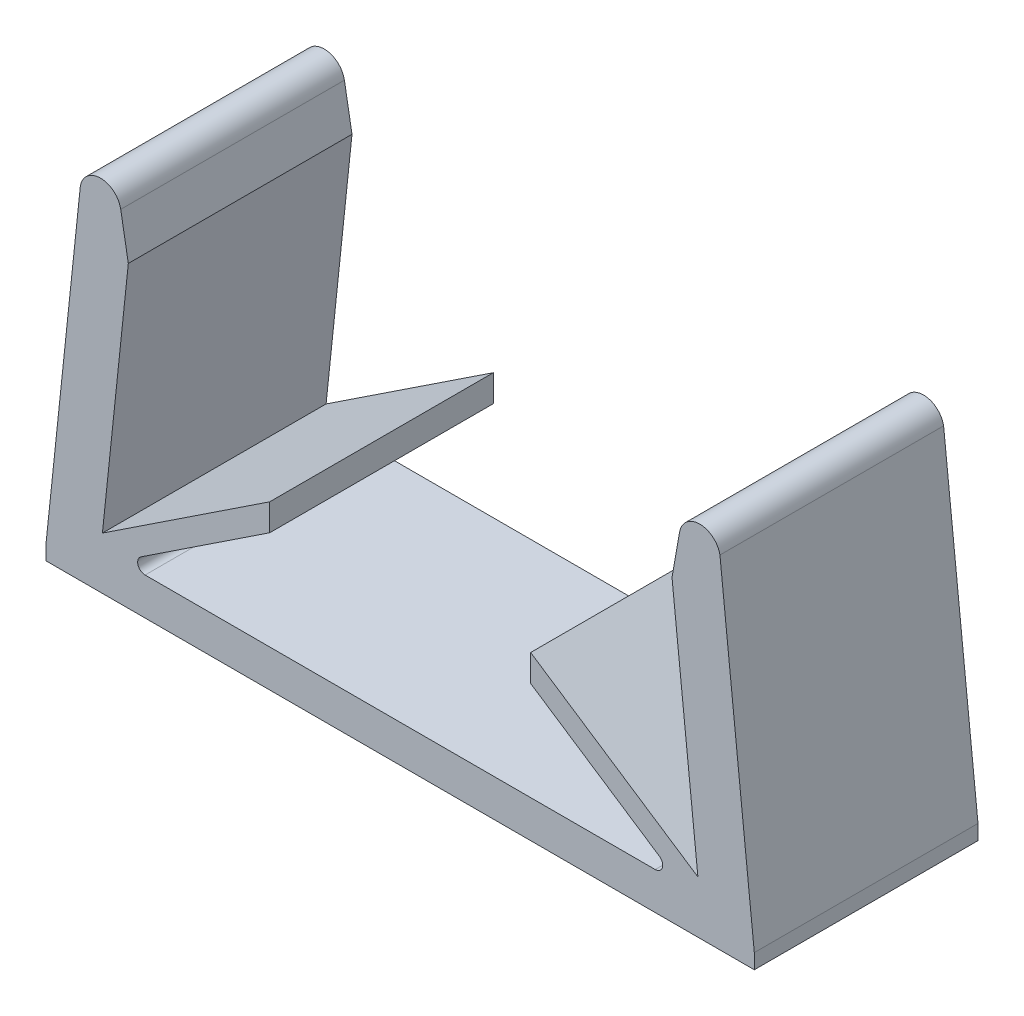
ISO-10303-21;
HEADER;
FILE_DESCRIPTION(('STEP AP214'),'2;1');
FILE_NAME('part.step','',(''),(''),'','','');
FILE_SCHEMA(('AUTOMOTIVE_DESIGN { 1 0 10303 214 1 1 1 1 }'));
ENDSEC;
DATA;
#1=APPLICATION_CONTEXT('core data for automotive mechanical design processes');
#2=APPLICATION_PROTOCOL_DEFINITION('international standard','automotive_design',2000,#1);
#3=PRODUCT_CONTEXT('',#1,'mechanical');
#4=PRODUCT('Part','Part','',(#3));
#5=PRODUCT_RELATED_PRODUCT_CATEGORY('part','',(#4));
#6=PRODUCT_DEFINITION_FORMATION('','',#4);
#7=PRODUCT_DEFINITION_CONTEXT('part definition',#1,'design');
#8=PRODUCT_DEFINITION('design','',#6,#7);
#9=PRODUCT_DEFINITION_SHAPE('','',#8);
#10=(LENGTH_UNIT() NAMED_UNIT(*) SI_UNIT(.MILLI.,.METRE.));
#11=(NAMED_UNIT(*) PLANE_ANGLE_UNIT() SI_UNIT($,.RADIAN.));
#12=(NAMED_UNIT(*) SI_UNIT($,.STERADIAN.) SOLID_ANGLE_UNIT());
#13=UNCERTAINTY_MEASURE_WITH_UNIT(LENGTH_MEASURE(1.E-05),#10,'distance_accuracy_value','');
#14=(GEOMETRIC_REPRESENTATION_CONTEXT(3) GLOBAL_UNCERTAINTY_ASSIGNED_CONTEXT((#13)) GLOBAL_UNIT_ASSIGNED_CONTEXT((#10,
#11,#12)) REPRESENTATION_CONTEXT('',''));
#15=CARTESIAN_POINT('',(0.,0.,0.));
#16=DIRECTION('',(0.,0.,1.));
#17=DIRECTION('',(1.,0.,0.));
#18=AXIS2_PLACEMENT_3D('',#15,#16,#17);
#19=CARTESIAN_POINT('',(6.84138339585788,1.20000000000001,3.));
#20=DIRECTION('',(0.,0.,-1.));
#21=DIRECTION('',(-1.,0.,0.));
#22=AXIS2_PLACEMENT_3D('',#19,#20,#21);
#23=CYLINDRICAL_SURFACE('',#22,0.2);
#24=CARTESIAN_POINT('',(6.84138339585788,1.20000000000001,-3.));
#25=DIRECTION('',(0.,0.,-1.));
#26=DIRECTION('',(-1.,0.,0.));
#27=AXIS2_PLACEMENT_3D('',#24,#25,#26);
#28=CIRCLE('',#27,0.2);
#29=CARTESIAN_POINT('',(6.95177079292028,1.36677716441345,-3.));
#30=VERTEX_POINT('',#29);
#31=CARTESIAN_POINT('',(6.84138339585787,1.00000000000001,-3.));
#32=VERTEX_POINT('',#31);
#33=EDGE_CURVE('E207',#30,#32,#28,.T.);
#34=ORIENTED_EDGE('',*,*,#33,.T.);
#35=DIRECTION('',(0.,0.,-1.));
#36=VECTOR('',#35,1.);
#37=CARTESIAN_POINT('',(6.84138339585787,1.00000000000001,3.));
#38=LINE('',#37,#36);
#39=CARTESIAN_POINT('',(6.84138339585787,1.00000000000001,3.));
#40=VERTEX_POINT('',#39);
#41=EDGE_CURVE('E11',#40,#32,#38,.T.);
#42=ORIENTED_EDGE('',*,*,#41,.F.);
#43=CARTESIAN_POINT('',(6.84138339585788,1.20000000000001,3.));
#44=DIRECTION('',(0.,0.,-1.));
#45=DIRECTION('',(-1.,0.,0.));
#46=AXIS2_PLACEMENT_3D('',#43,#44,#45);
#47=CIRCLE('',#46,0.2);
#48=CARTESIAN_POINT('',(6.95177079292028,1.36677716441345,3.));
#49=VERTEX_POINT('',#48);
#50=EDGE_CURVE('E245',#49,#40,#47,.T.);
#51=ORIENTED_EDGE('',*,*,#50,.F.);
#52=DIRECTION('',(0.,0.,-1.));
#53=VECTOR('',#52,1.);
#54=CARTESIAN_POINT('',(6.95177079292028,1.36677716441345,3.));
#55=LINE('',#54,#53);
#56=EDGE_CURVE('E203',#49,#30,#55,.T.);
#57=ORIENTED_EDGE('',*,*,#56,.T.);
#58=EDGE_LOOP('',(#34,#42,#51,#57));
#59=FACE_BOUND('',#58,.T.);
#60=ADVANCED_FACE('F39',(#59),#23,.F.);
#61=CARTESIAN_POINT('',(-6.84138339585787,1.00000000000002,3.));
#62=DIRECTION('',(0.,-1.,0.));
#63=DIRECTION('',(1.,0.,0.));
#64=AXIS2_PLACEMENT_3D('',#61,#62,#63);
#65=PLANE('',#64);
#66=DIRECTION('',(-1.,0.,0.));
#67=VECTOR('',#66,1.);
#68=CARTESIAN_POINT('',(-6.84138339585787,1.00000000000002,-3.));
#69=LINE('',#68,#67);
#70=CARTESIAN_POINT('',(-6.84138339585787,1.00000000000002,-3.));
#71=VERTEX_POINT('',#70);
#72=EDGE_CURVE('E210',#32,#71,#69,.T.);
#73=ORIENTED_EDGE('',*,*,#72,.T.);
#74=DIRECTION('',(0.,0.,-1.));
#75=VECTOR('',#74,1.);
#76=CARTESIAN_POINT('',(-6.84138339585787,1.00000000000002,3.));
#77=LINE('',#76,#75);
#78=CARTESIAN_POINT('',(-6.84138339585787,1.00000000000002,3.));
#79=VERTEX_POINT('',#78);
#80=EDGE_CURVE('E47',#79,#71,#77,.T.);
#81=ORIENTED_EDGE('',*,*,#80,.F.);
#82=DIRECTION('',(-1.,0.,0.));
#83=VECTOR('',#82,1.);
#84=CARTESIAN_POINT('',(-6.84138339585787,1.00000000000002,3.));
#85=LINE('',#84,#83);
#86=EDGE_CURVE('E134',#40,#79,#85,.T.);
#87=ORIENTED_EDGE('',*,*,#86,.F.);
#88=ORIENTED_EDGE('',*,*,#41,.T.);
#89=EDGE_LOOP('',(#73,#81,#87,#88));
#90=FACE_BOUND('',#89,.T.);
#91=ADVANCED_FACE('F363',(#90),#65,.F.);
#92=CARTESIAN_POINT('',(-6.84138339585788,1.20000000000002,3.));
#93=DIRECTION('',(0.,0.,-1.));
#94=DIRECTION('',(-1.,0.,0.));
#95=AXIS2_PLACEMENT_3D('',#92,#93,#94);
#96=CYLINDRICAL_SURFACE('',#95,0.2);
#97=CARTESIAN_POINT('',(-6.84138339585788,1.20000000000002,-3.));
#98=DIRECTION('',(0.,0.,-1.));
#99=DIRECTION('',(1.,0.,0.));
#100=AXIS2_PLACEMENT_3D('',#97,#98,#99);
#101=CIRCLE('',#100,0.2);
#102=CARTESIAN_POINT('',(-6.95177079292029,1.36677716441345,-3.));
#103=VERTEX_POINT('',#102);
#104=EDGE_CURVE('E212',#71,#103,#101,.T.);
#105=ORIENTED_EDGE('',*,*,#104,.T.);
#106=DIRECTION('',(0.,0.,-1.));
#107=VECTOR('',#106,1.);
#108=CARTESIAN_POINT('',(-6.95177079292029,1.36677716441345,3.));
#109=LINE('',#108,#107);
#110=CARTESIAN_POINT('',(-6.95177079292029,1.36677716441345,3.));
#111=VERTEX_POINT('',#110);
#112=EDGE_CURVE('E288',#111,#103,#109,.T.);
#113=ORIENTED_EDGE('',*,*,#112,.F.);
#114=CARTESIAN_POINT('',(-6.84138339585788,1.20000000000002,3.));
#115=DIRECTION('',(0.,0.,-1.));
#116=DIRECTION('',(1.,0.,0.));
#117=AXIS2_PLACEMENT_3D('',#114,#115,#116);
#118=CIRCLE('',#117,0.2);
#119=EDGE_CURVE('E296',#79,#111,#118,.T.);
#120=ORIENTED_EDGE('',*,*,#119,.F.);
#121=ORIENTED_EDGE('',*,*,#80,.T.);
#122=EDGE_LOOP('',(#105,#113,#120,#121));
#123=FACE_BOUND('',#122,.T.);
#124=ADVANCED_FACE('F294',(#123),#96,.F.);
#125=CARTESIAN_POINT('',(-3.5,3.65145441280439,3.));
#126=DIRECTION('',(-0.551936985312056,0.83388582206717,0.));
#127=DIRECTION('',(-0.83388582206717,-0.551936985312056,0.));
#128=AXIS2_PLACEMENT_3D('',#125,#126,#127);
#129=PLANE('',#128);
#130=DIRECTION('',(0.83388582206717,0.551936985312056,0.));
#131=VECTOR('',#130,1.);
#132=CARTESIAN_POINT('',(-3.5,3.65145441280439,-3.));
#133=LINE('',#132,#131);
#134=CARTESIAN_POINT('',(-3.5,3.65145441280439,-3.));
#135=VERTEX_POINT('',#134);
#136=EDGE_CURVE('E214',#103,#135,#133,.T.);
#137=ORIENTED_EDGE('',*,*,#136,.T.);
#138=DIRECTION('',(0.,0.,-1.));
#139=VECTOR('',#138,1.);
#140=CARTESIAN_POINT('',(-3.5,3.65145441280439,3.));
#141=LINE('',#140,#139);
#142=CARTESIAN_POINT('',(-3.5,3.65145441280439,3.));
#143=VERTEX_POINT('',#142);
#144=EDGE_CURVE('E285',#143,#135,#141,.T.);
#145=ORIENTED_EDGE('',*,*,#144,.F.);
#146=DIRECTION('',(0.83388582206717,0.551936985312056,0.));
#147=VECTOR('',#146,1.);
#148=CARTESIAN_POINT('',(-3.5,3.65145441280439,3.));
#149=LINE('',#148,#147);
#150=EDGE_CURVE('E314',#111,#143,#149,.T.);
#151=ORIENTED_EDGE('',*,*,#150,.F.);
#152=ORIENTED_EDGE('',*,*,#112,.T.);
#153=EDGE_LOOP('',(#137,#145,#151,#152));
#154=FACE_BOUND('',#153,.T.);
#155=ADVANCED_FACE('F305',(#154),#129,.F.);
#156=CARTESIAN_POINT('',(-3.5,3.65145441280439,3.));
#157=DIRECTION('',(-1.,0.,0.));
#158=DIRECTION('',(0.,0.,1.));
#159=AXIS2_PLACEMENT_3D('',#156,#157,#158);
#160=PLANE('',#159);
#161=DIRECTION('',(0.,1.,0.));
#162=VECTOR('',#161,1.);
#163=CARTESIAN_POINT('',(-3.5,3.65145441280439,-3.));
#164=LINE('',#163,#162);
#165=CARTESIAN_POINT('',(-3.5,4.37097737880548,-3.));
#166=VERTEX_POINT('',#165);
#167=EDGE_CURVE('E216',#135,#166,#164,.T.);
#168=ORIENTED_EDGE('',*,*,#167,.T.);
#169=DIRECTION('',(0.,0.,-1.));
#170=VECTOR('',#169,1.);
#171=CARTESIAN_POINT('',(-3.5,4.37097737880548,3.));
#172=LINE('',#171,#170);
#173=CARTESIAN_POINT('',(-3.5,4.37097737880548,3.));
#174=VERTEX_POINT('',#173);
#175=EDGE_CURVE('E282',#174,#166,#172,.T.);
#176=ORIENTED_EDGE('',*,*,#175,.F.);
#177=DIRECTION('',(0.,1.,0.));
#178=VECTOR('',#177,1.);
#179=CARTESIAN_POINT('',(-3.5,3.65145441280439,3.));
#180=LINE('',#179,#178);
#181=EDGE_CURVE('E311',#143,#174,#180,.T.);
#182=ORIENTED_EDGE('',*,*,#181,.F.);
#183=ORIENTED_EDGE('',*,*,#144,.T.);
#184=EDGE_LOOP('',(#168,#176,#182,#183));
#185=FACE_BOUND('',#184,.T.);
#186=ADVANCED_FACE('F309',(#185),#160,.F.);
#187=CARTESIAN_POINT('',(-3.5,4.37097737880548,3.));
#188=DIRECTION('',(0.551936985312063,-0.833885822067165,0.));
#189=DIRECTION('',(0.833885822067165,0.551936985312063,0.));
#190=AXIS2_PLACEMENT_3D('',#187,#188,#189);
#191=PLANE('',#190);
#192=DIRECTION('',(-0.833885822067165,-0.551936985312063,0.));
#193=VECTOR('',#192,1.);
#194=CARTESIAN_POINT('',(-3.5,4.37097737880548,-3.));
#195=LINE('',#194,#193);
#196=CARTESIAN_POINT('',(-7.98652846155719,1.40140897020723,-3.));
#197=VERTEX_POINT('',#196);
#198=EDGE_CURVE('E218',#166,#197,#195,.T.);
#199=ORIENTED_EDGE('',*,*,#198,.T.);
#200=DIRECTION('',(0.,0.,-1.));
#201=VECTOR('',#200,1.);
#202=CARTESIAN_POINT('',(-7.98652846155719,1.40140897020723,3.));
#203=LINE('',#202,#201);
#204=CARTESIAN_POINT('',(-7.98652846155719,1.40140897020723,3.));
#205=VERTEX_POINT('',#204);
#206=EDGE_CURVE('E279',#205,#197,#203,.T.);
#207=ORIENTED_EDGE('',*,*,#206,.F.);
#208=DIRECTION('',(-0.833885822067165,-0.551936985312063,0.));
#209=VECTOR('',#208,1.);
#210=CARTESIAN_POINT('',(-3.5,4.37097737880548,3.));
#211=LINE('',#210,#209);
#212=EDGE_CURVE('E313',#174,#205,#211,.T.);
#213=ORIENTED_EDGE('',*,*,#212,.F.);
#214=ORIENTED_EDGE('',*,*,#175,.T.);
#215=EDGE_LOOP('',(#199,#207,#213,#214));
#216=FACE_BOUND('',#215,.T.);
#217=ADVANCED_FACE('F376',(#216),#191,.F.);
#218=CARTESIAN_POINT('',(-7.98652846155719,1.40140897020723,3.));
#219=DIRECTION('',(-0.994521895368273,0.104528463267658,0.));
#220=DIRECTION('',(-0.104528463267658,-0.994521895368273,0.));
#221=AXIS2_PLACEMENT_3D('',#218,#219,#220);
#222=PLANE('',#221);
#223=DIRECTION('',(0.104528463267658,0.994521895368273,0.));
#224=VECTOR('',#223,1.);
#225=CARTESIAN_POINT('',(-7.98652846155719,1.40140897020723,-3.));
#226=LINE('',#225,#224);
#227=CARTESIAN_POINT('',(-7.29164318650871,8.01280073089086,-3.));
#228=VERTEX_POINT('',#227);
#229=EDGE_CURVE('E220',#197,#228,#226,.T.);
#230=ORIENTED_EDGE('',*,*,#229,.T.);
#231=DIRECTION('',(0.,0.,-1.));
#232=VECTOR('',#231,1.);
#233=CARTESIAN_POINT('',(-7.29164318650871,8.01280073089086,3.));
#234=LINE('',#233,#232);
#235=CARTESIAN_POINT('',(-7.29164318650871,8.01280073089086,3.));
#236=VERTEX_POINT('',#235);
#237=EDGE_CURVE('E276',#236,#228,#234,.T.);
#238=ORIENTED_EDGE('',*,*,#237,.F.);
#239=DIRECTION('',(0.104528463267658,0.994521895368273,0.));
#240=VECTOR('',#239,1.);
#241=CARTESIAN_POINT('',(-7.98652846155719,1.40140897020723,3.));
#242=LINE('',#241,#240);
#243=EDGE_CURVE('E316',#205,#236,#242,.T.);
#244=ORIENTED_EDGE('',*,*,#243,.F.);
#245=ORIENTED_EDGE('',*,*,#206,.T.);
#246=EDGE_LOOP('',(#230,#238,#244,#245));
#247=FACE_BOUND('',#246,.T.);
#248=ADVANCED_FACE('F379',(#247),#222,.F.);
#249=CARTESIAN_POINT('',(-7.49524280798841,9.16747156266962,3.));
#250=DIRECTION('',(-0.984807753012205,-0.173648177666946,0.));
#251=DIRECTION('',(0.173648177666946,-0.984807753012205,0.));
#252=AXIS2_PLACEMENT_3D('',#249,#250,#251);
#253=PLANE('',#252);
#254=DIRECTION('',(-0.173648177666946,0.984807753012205,0.));
#255=VECTOR('',#254,1.);
#256=CARTESIAN_POINT('',(-7.49524280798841,9.16747156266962,-3.));
#257=LINE('',#256,#255);
#258=CARTESIAN_POINT('',(-7.49524280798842,9.16747156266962,-3.));
#259=VERTEX_POINT('',#258);
#260=EDGE_CURVE('E222',#228,#259,#257,.T.);
#261=ORIENTED_EDGE('',*,*,#260,.T.);
#262=DIRECTION('',(0.,0.,-1.));
#263=VECTOR('',#262,1.);
#264=CARTESIAN_POINT('',(-7.49524280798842,9.16747156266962,3.));
#265=LINE('',#264,#263);
#266=CARTESIAN_POINT('',(-7.49524280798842,9.16747156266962,3.));
#267=VERTEX_POINT('',#266);
#268=EDGE_CURVE('E273',#267,#259,#265,.T.);
#269=ORIENTED_EDGE('',*,*,#268,.F.);
#270=DIRECTION('',(-0.173648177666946,0.984807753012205,0.));
#271=VECTOR('',#270,1.);
#272=CARTESIAN_POINT('',(-7.49524280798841,9.16747156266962,3.));
#273=LINE('',#272,#271);
#274=EDGE_CURVE('E322',#236,#267,#273,.T.);
#275=ORIENTED_EDGE('',*,*,#274,.F.);
#276=ORIENTED_EDGE('',*,*,#237,.T.);
#277=EDGE_LOOP('',(#261,#269,#275,#276));
#278=FACE_BOUND('',#277,.T.);
#279=ADVANCED_FACE('F383',(#278),#253,.F.);
#280=CARTESIAN_POINT('',(-8.03688707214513,9.07196506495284,3.));
#281=DIRECTION('',(0.,0.,-1.));
#282=DIRECTION('',(-1.,0.,0.));
#283=AXIS2_PLACEMENT_3D('',#280,#281,#282);
#284=CYLINDRICAL_SURFACE('',#283,0.549999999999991);
#285=CARTESIAN_POINT('',(-8.03688707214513,9.07196506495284,-3.));
#286=DIRECTION('',(0.,0.,1.));
#287=DIRECTION('',(1.,0.,0.));
#288=AXIS2_PLACEMENT_3D('',#285,#286,#287);
#289=CIRCLE('',#288,0.549999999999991);
#290=CARTESIAN_POINT('',(-8.57726814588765,9.17437744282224,-3.));
#291=VERTEX_POINT('',#290);
#292=EDGE_CURVE('E224',#259,#291,#289,.T.);
#293=ORIENTED_EDGE('',*,*,#292,.T.);
#294=DIRECTION('',(0.,0.,-1.));
#295=VECTOR('',#294,1.);
#296=CARTESIAN_POINT('',(-8.57726814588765,9.17437744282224,3.));
#297=LINE('',#296,#295);
#298=CARTESIAN_POINT('',(-8.57726814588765,9.17437744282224,3.));
#299=VERTEX_POINT('',#298);
#300=EDGE_CURVE('E270',#299,#291,#297,.T.);
#301=ORIENTED_EDGE('',*,*,#300,.F.);
#302=CARTESIAN_POINT('',(-8.03688707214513,9.07196506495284,3.));
#303=DIRECTION('',(0.,0.,1.));
#304=DIRECTION('',(1.,0.,0.));
#305=AXIS2_PLACEMENT_3D('',#302,#303,#304);
#306=CIRCLE('',#305,0.549999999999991);
#307=EDGE_CURVE('E324',#267,#299,#306,.T.);
#308=ORIENTED_EDGE('',*,*,#307,.F.);
#309=ORIENTED_EDGE('',*,*,#268,.T.);
#310=EDGE_LOOP('',(#293,#301,#308,#309));
#311=FACE_BOUND('',#310,.T.);
#312=ADVANCED_FACE('F387',(#311),#284,.T.);
#313=CARTESIAN_POINT('',(-9.4994923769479,0.400000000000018,3.));
#314=DIRECTION('',(0.994521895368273,-0.104528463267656,0.));
#315=DIRECTION('',(0.104528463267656,0.994521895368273,0.));
#316=AXIS2_PLACEMENT_3D('',#313,#314,#315);
#317=PLANE('',#316);
#318=DIRECTION('',(-0.104528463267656,-0.994521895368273,0.));
#319=VECTOR('',#318,1.);
#320=CARTESIAN_POINT('',(-9.4994923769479,0.400000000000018,-3.));
#321=LINE('',#320,#319);
#322=CARTESIAN_POINT('',(-9.4994923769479,0.400000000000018,-3.));
#323=VERTEX_POINT('',#322);
#324=EDGE_CURVE('E226',#291,#323,#321,.T.);
#325=ORIENTED_EDGE('',*,*,#324,.T.);
#326=DIRECTION('',(0.,0.,-1.));
#327=VECTOR('',#326,1.);
#328=CARTESIAN_POINT('',(-9.4994923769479,0.400000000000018,3.));
#329=LINE('',#328,#327);
#330=CARTESIAN_POINT('',(-9.4994923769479,0.400000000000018,3.));
#331=VERTEX_POINT('',#330);
#332=EDGE_CURVE('E267',#331,#323,#329,.T.);
#333=ORIENTED_EDGE('',*,*,#332,.F.);
#334=DIRECTION('',(-0.104528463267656,-0.994521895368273,0.));
#335=VECTOR('',#334,1.);
#336=CARTESIAN_POINT('',(-9.4994923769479,0.400000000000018,3.));
#337=LINE('',#336,#335);
#338=EDGE_CURVE('E326',#299,#331,#337,.T.);
#339=ORIENTED_EDGE('',*,*,#338,.F.);
#340=ORIENTED_EDGE('',*,*,#300,.T.);
#341=EDGE_LOOP('',(#325,#333,#339,#340));
#342=FACE_BOUND('',#341,.T.);
#343=ADVANCED_FACE('F391',(#342),#317,.F.);
#344=CARTESIAN_POINT('',(-9.4994923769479,0.,3.));
#345=DIRECTION('',(1.,0.,0.));
#346=DIRECTION('',(0.,0.,-1.));
#347=AXIS2_PLACEMENT_3D('',#344,#345,#346);
#348=PLANE('',#347);
#349=DIRECTION('',(0.,-1.,0.));
#350=VECTOR('',#349,1.);
#351=CARTESIAN_POINT('',(-9.4994923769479,0.,-3.));
#352=LINE('',#351,#350);
#353=CARTESIAN_POINT('',(-9.4994923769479,0.,-3.));
#354=VERTEX_POINT('',#353);
#355=EDGE_CURVE('E228',#323,#354,#352,.T.);
#356=ORIENTED_EDGE('',*,*,#355,.T.);
#357=DIRECTION('',(0.,0.,-1.));
#358=VECTOR('',#357,1.);
#359=CARTESIAN_POINT('',(-9.4994923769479,0.,3.));
#360=LINE('',#359,#358);
#361=CARTESIAN_POINT('',(-9.4994923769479,0.,3.));
#362=VERTEX_POINT('',#361);
#363=EDGE_CURVE('E264',#362,#354,#360,.T.);
#364=ORIENTED_EDGE('',*,*,#363,.F.);
#365=DIRECTION('',(0.,-1.,0.));
#366=VECTOR('',#365,1.);
#367=CARTESIAN_POINT('',(-9.4994923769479,0.,3.));
#368=LINE('',#367,#366);
#369=EDGE_CURVE('E328',#331,#362,#368,.T.);
#370=ORIENTED_EDGE('',*,*,#369,.F.);
#371=ORIENTED_EDGE('',*,*,#332,.T.);
#372=EDGE_LOOP('',(#356,#364,#370,#371));
#373=FACE_BOUND('',#372,.T.);
#374=ADVANCED_FACE('F395',(#373),#348,.F.);
#375=CARTESIAN_POINT('',(-9.4994923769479,0.,3.));
#376=DIRECTION('',(0.,1.,0.));
#377=DIRECTION('',(-1.,0.,0.));
#378=AXIS2_PLACEMENT_3D('',#375,#376,#377);
#379=PLANE('',#378);
#380=DIRECTION('',(1.,0.,0.));
#381=VECTOR('',#380,1.);
#382=CARTESIAN_POINT('',(-9.4994923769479,0.,-3.));
#383=LINE('',#382,#381);
#384=CARTESIAN_POINT('',(9.4994923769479,0.,-3.));
#385=VERTEX_POINT('',#384);
#386=EDGE_CURVE('E230',#354,#385,#383,.T.);
#387=ORIENTED_EDGE('',*,*,#386,.T.);
#388=DIRECTION('',(0.,0.,-1.));
#389=VECTOR('',#388,1.);
#390=CARTESIAN_POINT('',(9.4994923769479,0.,3.));
#391=LINE('',#390,#389);
#392=CARTESIAN_POINT('',(9.4994923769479,0.,3.));
#393=VERTEX_POINT('',#392);
#394=EDGE_CURVE('E261',#393,#385,#391,.T.);
#395=ORIENTED_EDGE('',*,*,#394,.F.);
#396=DIRECTION('',(1.,0.,0.));
#397=VECTOR('',#396,1.);
#398=CARTESIAN_POINT('',(-9.4994923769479,0.,3.));
#399=LINE('',#398,#397);
#400=EDGE_CURVE('E330',#362,#393,#399,.T.);
#401=ORIENTED_EDGE('',*,*,#400,.F.);
#402=ORIENTED_EDGE('',*,*,#363,.T.);
#403=EDGE_LOOP('',(#387,#395,#401,#402));
#404=FACE_BOUND('',#403,.T.);
#405=ADVANCED_FACE('F399',(#404),#379,.F.);
#406=CARTESIAN_POINT('',(9.4994923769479,0.,3.));
#407=DIRECTION('',(-1.,0.,0.));
#408=DIRECTION('',(0.,0.,1.));
#409=AXIS2_PLACEMENT_3D('',#406,#407,#408);
#410=PLANE('',#409);
#411=DIRECTION('',(0.,1.,0.));
#412=VECTOR('',#411,1.);
#413=CARTESIAN_POINT('',(9.4994923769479,0.,-3.));
#414=LINE('',#413,#412);
#415=CARTESIAN_POINT('',(9.4994923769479,0.400000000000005,-3.));
#416=VERTEX_POINT('',#415);
#417=EDGE_CURVE('E232',#385,#416,#414,.T.);
#418=ORIENTED_EDGE('',*,*,#417,.T.);
#419=DIRECTION('',(0.,0.,-1.));
#420=VECTOR('',#419,1.);
#421=CARTESIAN_POINT('',(9.4994923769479,0.400000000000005,3.));
#422=LINE('',#421,#420);
#423=CARTESIAN_POINT('',(9.4994923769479,0.400000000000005,3.));
#424=VERTEX_POINT('',#423);
#425=EDGE_CURVE('E258',#424,#416,#422,.T.);
#426=ORIENTED_EDGE('',*,*,#425,.F.);
#427=DIRECTION('',(0.,1.,0.));
#428=VECTOR('',#427,1.);
#429=CARTESIAN_POINT('',(9.4994923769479,0.,3.));
#430=LINE('',#429,#428);
#431=EDGE_CURVE('E332',#393,#424,#430,.T.);
#432=ORIENTED_EDGE('',*,*,#431,.F.);
#433=ORIENTED_EDGE('',*,*,#394,.T.);
#434=EDGE_LOOP('',(#418,#426,#432,#433));
#435=FACE_BOUND('',#434,.T.);
#436=ADVANCED_FACE('F403',(#435),#410,.F.);
#437=CARTESIAN_POINT('',(9.4994923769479,0.400000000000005,3.));
#438=DIRECTION('',(-0.994521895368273,-0.104528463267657,0.));
#439=DIRECTION('',(0.104528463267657,-0.994521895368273,0.));
#440=AXIS2_PLACEMENT_3D('',#437,#438,#439);
#441=PLANE('',#440);
#442=DIRECTION('',(-0.104528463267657,0.994521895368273,0.));
#443=VECTOR('',#442,1.);
#444=CARTESIAN_POINT('',(9.4994923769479,0.400000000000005,-3.));
#445=LINE('',#444,#443);
#446=CARTESIAN_POINT('',(8.57726814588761,9.1743774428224,-3.));
#447=VERTEX_POINT('',#446);
#448=EDGE_CURVE('E234',#416,#447,#445,.T.);
#449=ORIENTED_EDGE('',*,*,#448,.T.);
#450=DIRECTION('',(0.,0.,-1.));
#451=VECTOR('',#450,1.);
#452=CARTESIAN_POINT('',(8.57726814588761,9.1743774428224,3.));
#453=LINE('',#452,#451);
#454=CARTESIAN_POINT('',(8.57726814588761,9.1743774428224,3.));
#455=VERTEX_POINT('',#454);
#456=EDGE_CURVE('E255',#455,#447,#453,.T.);
#457=ORIENTED_EDGE('',*,*,#456,.F.);
#458=DIRECTION('',(-0.104528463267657,0.994521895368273,0.));
#459=VECTOR('',#458,1.);
#460=CARTESIAN_POINT('',(9.4994923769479,0.400000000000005,3.));
#461=LINE('',#460,#459);
#462=EDGE_CURVE('E334',#424,#455,#461,.T.);
#463=ORIENTED_EDGE('',*,*,#462,.F.);
#464=ORIENTED_EDGE('',*,*,#425,.T.);
#465=EDGE_LOOP('',(#449,#457,#463,#464));
#466=FACE_BOUND('',#465,.T.);
#467=ADVANCED_FACE('F407',(#466),#441,.F.);
#468=CARTESIAN_POINT('',(8.03688707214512,9.07196506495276,3.));
#469=DIRECTION('',(0.,0.,-1.));
#470=DIRECTION('',(-1.,0.,0.));
#471=AXIS2_PLACEMENT_3D('',#468,#469,#470);
#472=CYLINDRICAL_SURFACE('',#471,0.55);
#473=CARTESIAN_POINT('',(8.03688707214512,9.07196506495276,-3.));
#474=DIRECTION('',(0.,0.,1.));
#475=DIRECTION('',(1.,0.,0.));
#476=AXIS2_PLACEMENT_3D('',#473,#474,#475);
#477=CIRCLE('',#476,0.55);
#478=CARTESIAN_POINT('',(7.49524280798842,9.16747156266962,-3.));
#479=VERTEX_POINT('',#478);
#480=EDGE_CURVE('E236',#447,#479,#477,.T.);
#481=ORIENTED_EDGE('',*,*,#480,.T.);
#482=DIRECTION('',(0.,0.,-1.));
#483=VECTOR('',#482,1.);
#484=CARTESIAN_POINT('',(7.49524280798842,9.16747156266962,3.));
#485=LINE('',#484,#483);
#486=CARTESIAN_POINT('',(7.49524280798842,9.16747156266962,3.));
#487=VERTEX_POINT('',#486);
#488=EDGE_CURVE('E252',#487,#479,#485,.T.);
#489=ORIENTED_EDGE('',*,*,#488,.F.);
#490=CARTESIAN_POINT('',(8.03688707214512,9.07196506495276,3.));
#491=DIRECTION('',(0.,0.,1.));
#492=DIRECTION('',(1.,0.,0.));
#493=AXIS2_PLACEMENT_3D('',#490,#491,#492);
#494=CIRCLE('',#493,0.55);
#495=EDGE_CURVE('E336',#455,#487,#494,.T.);
#496=ORIENTED_EDGE('',*,*,#495,.F.);
#497=ORIENTED_EDGE('',*,*,#456,.T.);
#498=EDGE_LOOP('',(#481,#489,#496,#497));
#499=FACE_BOUND('',#498,.T.);
#500=ADVANCED_FACE('F411',(#499),#472,.T.);
#501=CARTESIAN_POINT('',(7.49524280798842,9.16747156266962,3.));
#502=DIRECTION('',(0.984807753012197,-0.173648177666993,0.));
#503=DIRECTION('',(0.173648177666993,0.984807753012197,0.));
#504=AXIS2_PLACEMENT_3D('',#501,#502,#503);
#505=PLANE('',#504);
#506=DIRECTION('',(-0.173648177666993,-0.984807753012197,0.));
#507=VECTOR('',#506,1.);
#508=CARTESIAN_POINT('',(7.49524280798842,9.16747156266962,-3.));
#509=LINE('',#508,#507);
#510=CARTESIAN_POINT('',(7.29164318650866,8.01280073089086,-3.));
#511=VERTEX_POINT('',#510);
#512=EDGE_CURVE('E238',#479,#511,#509,.T.);
#513=ORIENTED_EDGE('',*,*,#512,.T.);
#514=DIRECTION('',(0.,0.,-1.));
#515=VECTOR('',#514,1.);
#516=CARTESIAN_POINT('',(7.29164318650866,8.01280073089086,3.));
#517=LINE('',#516,#515);
#518=CARTESIAN_POINT('',(7.29164318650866,8.01280073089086,3.));
#519=VERTEX_POINT('',#518);
#520=EDGE_CURVE('E249',#519,#511,#517,.T.);
#521=ORIENTED_EDGE('',*,*,#520,.F.);
#522=DIRECTION('',(-0.173648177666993,-0.984807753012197,0.));
#523=VECTOR('',#522,1.);
#524=CARTESIAN_POINT('',(7.49524280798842,9.16747156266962,3.));
#525=LINE('',#524,#523);
#526=EDGE_CURVE('E338',#487,#519,#525,.T.);
#527=ORIENTED_EDGE('',*,*,#526,.F.);
#528=ORIENTED_EDGE('',*,*,#488,.T.);
#529=EDGE_LOOP('',(#513,#521,#527,#528));
#530=FACE_BOUND('',#529,.T.);
#531=ADVANCED_FACE('F344',(#530),#505,.F.);
#532=CARTESIAN_POINT('',(7.98652846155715,1.40140897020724,3.));
#533=DIRECTION('',(0.994521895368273,0.10452846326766,0.));
#534=DIRECTION('',(-0.10452846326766,0.994521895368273,0.));
#535=AXIS2_PLACEMENT_3D('',#532,#533,#534);
#536=PLANE('',#535);
#537=DIRECTION('',(0.10452846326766,-0.994521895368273,0.));
#538=VECTOR('',#537,1.);
#539=CARTESIAN_POINT('',(7.98652846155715,1.40140897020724,-3.));
#540=LINE('',#539,#538);
#541=CARTESIAN_POINT('',(7.98652846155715,1.40140897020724,-3.));
#542=VERTEX_POINT('',#541);
#543=EDGE_CURVE('E240',#511,#542,#540,.T.);
#544=ORIENTED_EDGE('',*,*,#543,.T.);
#545=DIRECTION('',(0.,0.,-1.));
#546=VECTOR('',#545,1.);
#547=CARTESIAN_POINT('',(7.98652846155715,1.40140897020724,3.));
#548=LINE('',#547,#546);
#549=CARTESIAN_POINT('',(7.98652846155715,1.40140897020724,3.));
#550=VERTEX_POINT('',#549);
#551=EDGE_CURVE('E198',#550,#542,#548,.T.);
#552=ORIENTED_EDGE('',*,*,#551,.F.);
#553=DIRECTION('',(0.10452846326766,-0.994521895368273,0.));
#554=VECTOR('',#553,1.);
#555=CARTESIAN_POINT('',(7.98652846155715,1.40140897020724,3.));
#556=LINE('',#555,#554);
#557=EDGE_CURVE('E189',#519,#550,#556,.T.);
#558=ORIENTED_EDGE('',*,*,#557,.F.);
#559=ORIENTED_EDGE('',*,*,#520,.T.);
#560=EDGE_LOOP('',(#544,#552,#558,#559));
#561=FACE_BOUND('',#560,.T.);
#562=ADVANCED_FACE('F348',(#561),#536,.F.);
#563=CARTESIAN_POINT('',(3.50000000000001,4.37097737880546,3.));
#564=DIRECTION('',(-0.551936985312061,-0.833885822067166,0.));
#565=DIRECTION('',(0.833885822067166,-0.551936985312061,0.));
#566=AXIS2_PLACEMENT_3D('',#563,#564,#565);
#567=PLANE('',#566);
#568=DIRECTION('',(-0.833885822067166,0.551936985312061,0.));
#569=VECTOR('',#568,1.);
#570=CARTESIAN_POINT('',(3.50000000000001,4.37097737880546,-3.));
#571=LINE('',#570,#569);
#572=CARTESIAN_POINT('',(3.50000000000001,4.37097737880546,-3.));
#573=VERTEX_POINT('',#572);
#574=EDGE_CURVE('E197',#542,#573,#571,.T.);
#575=ORIENTED_EDGE('',*,*,#574,.T.);
#576=DIRECTION('',(0.,0.,-1.));
#577=VECTOR('',#576,1.);
#578=CARTESIAN_POINT('',(3.50000000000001,4.37097737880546,3.));
#579=LINE('',#578,#577);
#580=CARTESIAN_POINT('',(3.50000000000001,4.37097737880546,3.));
#581=VERTEX_POINT('',#580);
#582=EDGE_CURVE('E194',#581,#573,#579,.T.);
#583=ORIENTED_EDGE('',*,*,#582,.F.);
#584=DIRECTION('',(-0.833885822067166,0.551936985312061,0.));
#585=VECTOR('',#584,1.);
#586=CARTESIAN_POINT('',(3.50000000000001,4.37097737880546,3.));
#587=LINE('',#586,#585);
#588=EDGE_CURVE('E183',#550,#581,#587,.T.);
#589=ORIENTED_EDGE('',*,*,#588,.F.);
#590=ORIENTED_EDGE('',*,*,#551,.T.);
#591=EDGE_LOOP('',(#575,#583,#589,#590));
#592=FACE_BOUND('',#591,.T.);
#593=ADVANCED_FACE('F195',(#592),#567,.F.);
#594=CARTESIAN_POINT('',(3.50000000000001,3.65145441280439,3.));
#595=DIRECTION('',(1.,0.,0.));
#596=DIRECTION('',(0.,0.,-1.));
#597=AXIS2_PLACEMENT_3D('',#594,#595,#596);
#598=PLANE('',#597);
#599=DIRECTION('',(0.,-1.,0.));
#600=VECTOR('',#599,1.);
#601=CARTESIAN_POINT('',(3.50000000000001,3.65145441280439,-3.));
#602=LINE('',#601,#600);
#603=CARTESIAN_POINT('',(3.50000000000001,3.65145441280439,-3.));
#604=VERTEX_POINT('',#603);
#605=EDGE_CURVE('E120',#573,#604,#602,.T.);
#606=ORIENTED_EDGE('',*,*,#605,.T.);
#607=DIRECTION('',(0.,0.,-1.));
#608=VECTOR('',#607,1.);
#609=CARTESIAN_POINT('',(3.50000000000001,3.65145441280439,3.));
#610=LINE('',#609,#608);
#611=CARTESIAN_POINT('',(3.50000000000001,3.65145441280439,3.));
#612=VERTEX_POINT('',#611);
#613=EDGE_CURVE('E199',#612,#604,#610,.T.);
#614=ORIENTED_EDGE('',*,*,#613,.F.);
#615=DIRECTION('',(0.,-1.,0.));
#616=VECTOR('',#615,1.);
#617=CARTESIAN_POINT('',(3.50000000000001,3.65145441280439,3.));
#618=LINE('',#617,#616);
#619=EDGE_CURVE('E187',#581,#612,#618,.T.);
#620=ORIENTED_EDGE('',*,*,#619,.F.);
#621=ORIENTED_EDGE('',*,*,#582,.T.);
#622=EDGE_LOOP('',(#606,#614,#620,#621));
#623=FACE_BOUND('',#622,.T.);
#624=ADVANCED_FACE('F201',(#623),#598,.F.);
#625=CARTESIAN_POINT('',(3.50000000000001,3.65145441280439,3.));
#626=DIRECTION('',(0.551936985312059,0.833885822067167,0.));
#627=DIRECTION('',(-0.833885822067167,0.55193698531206,0.));
#628=AXIS2_PLACEMENT_3D('',#625,#626,#627);
#629=PLANE('',#628);
#630=DIRECTION('',(0.833885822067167,-0.551936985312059,0.));
#631=VECTOR('',#630,1.);
#632=CARTESIAN_POINT('',(3.50000000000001,3.65145441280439,-3.));
#633=LINE('',#632,#631);
#634=EDGE_CURVE('E126',#604,#30,#633,.T.);
#635=ORIENTED_EDGE('',*,*,#634,.T.);
#636=ORIENTED_EDGE('',*,*,#56,.F.);
#637=DIRECTION('',(0.833885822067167,-0.551936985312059,0.));
#638=VECTOR('',#637,1.);
#639=CARTESIAN_POINT('',(3.50000000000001,3.65145441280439,3.));
#640=LINE('',#639,#638);
#641=EDGE_CURVE('E55',#612,#49,#640,.T.);
#642=ORIENTED_EDGE('',*,*,#641,.F.);
#643=ORIENTED_EDGE('',*,*,#613,.T.);
#644=EDGE_LOOP('',(#635,#636,#642,#643));
#645=FACE_BOUND('',#644,.T.);
#646=ADVANCED_FACE('F352',(#645),#629,.F.);
#647=CARTESIAN_POINT('',(6.84138339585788,1.20000000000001,3.));
#648=DIRECTION('',(0.,0.,-1.));
#649=DIRECTION('',(-1.,0.,0.));
#650=AXIS2_PLACEMENT_3D('',#647,#648,#649);
#651=PLANE('',#650);
#652=ORIENTED_EDGE('',*,*,#50,.T.);
#653=ORIENTED_EDGE('',*,*,#86,.T.);
#654=ORIENTED_EDGE('',*,*,#119,.T.);
#655=ORIENTED_EDGE('',*,*,#150,.T.);
#656=ORIENTED_EDGE('',*,*,#181,.T.);
#657=ORIENTED_EDGE('',*,*,#212,.T.);
#658=ORIENTED_EDGE('',*,*,#243,.T.);
#659=ORIENTED_EDGE('',*,*,#274,.T.);
#660=ORIENTED_EDGE('',*,*,#307,.T.);
#661=ORIENTED_EDGE('',*,*,#338,.T.);
#662=ORIENTED_EDGE('',*,*,#369,.T.);
#663=ORIENTED_EDGE('',*,*,#400,.T.);
#664=ORIENTED_EDGE('',*,*,#431,.T.);
#665=ORIENTED_EDGE('',*,*,#462,.T.);
#666=ORIENTED_EDGE('',*,*,#495,.T.);
#667=ORIENTED_EDGE('',*,*,#526,.T.);
#668=ORIENTED_EDGE('',*,*,#557,.T.);
#669=ORIENTED_EDGE('',*,*,#588,.T.);
#670=ORIENTED_EDGE('',*,*,#619,.T.);
#671=ORIENTED_EDGE('',*,*,#641,.T.);
#672=EDGE_LOOP('',(#652,#653,#654,#655,#656,#657,#658,#659,#660,#661,#662,#663,#664,#665,#666,
#667,#668,#669,#670,#671));
#673=FACE_BOUND('',#672,.T.);
#674=ADVANCED_FACE('F185',(#673),#651,.F.);
#675=CARTESIAN_POINT('',(6.84138339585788,1.20000000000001,-3.));
#676=DIRECTION('',(0.,0.,-1.));
#677=DIRECTION('',(-1.,0.,0.));
#678=AXIS2_PLACEMENT_3D('',#675,#676,#677);
#679=PLANE('',#678);
#680=ORIENTED_EDGE('',*,*,#33,.F.);
#681=ORIENTED_EDGE('',*,*,#634,.F.);
#682=ORIENTED_EDGE('',*,*,#605,.F.);
#683=ORIENTED_EDGE('',*,*,#574,.F.);
#684=ORIENTED_EDGE('',*,*,#543,.F.);
#685=ORIENTED_EDGE('',*,*,#512,.F.);
#686=ORIENTED_EDGE('',*,*,#480,.F.);
#687=ORIENTED_EDGE('',*,*,#448,.F.);
#688=ORIENTED_EDGE('',*,*,#417,.F.);
#689=ORIENTED_EDGE('',*,*,#386,.F.);
#690=ORIENTED_EDGE('',*,*,#355,.F.);
#691=ORIENTED_EDGE('',*,*,#324,.F.);
#692=ORIENTED_EDGE('',*,*,#292,.F.);
#693=ORIENTED_EDGE('',*,*,#260,.F.);
#694=ORIENTED_EDGE('',*,*,#229,.F.);
#695=ORIENTED_EDGE('',*,*,#198,.F.);
#696=ORIENTED_EDGE('',*,*,#167,.F.);
#697=ORIENTED_EDGE('',*,*,#136,.F.);
#698=ORIENTED_EDGE('',*,*,#104,.F.);
#699=ORIENTED_EDGE('',*,*,#72,.F.);
#700=EDGE_LOOP('',(#680,#681,#682,#683,#684,#685,#686,#687,#688,#689,#690,#691,#692,#693,#694,
#695,#696,#697,#698,#699));
#701=FACE_BOUND('',#700,.T.);
#702=ADVANCED_FACE('F300',(#701),#679,.T.);
#703=CLOSED_SHELL('',(#60,#91,#124,#155,#186,#217,#248,#279,#312,#343,#374,#405,#436,#467,#500,
#531,#562,#593,#624,#646,#674,#702));
#704=MANIFOLD_SOLID_BREP('B2',#703);
#705=ADVANCED_BREP_SHAPE_REPRESENTATION('',(#18,#704),#14);
#706=SHAPE_DEFINITION_REPRESENTATION(#9,#705);
ENDSEC;
END-ISO-10303-21;
